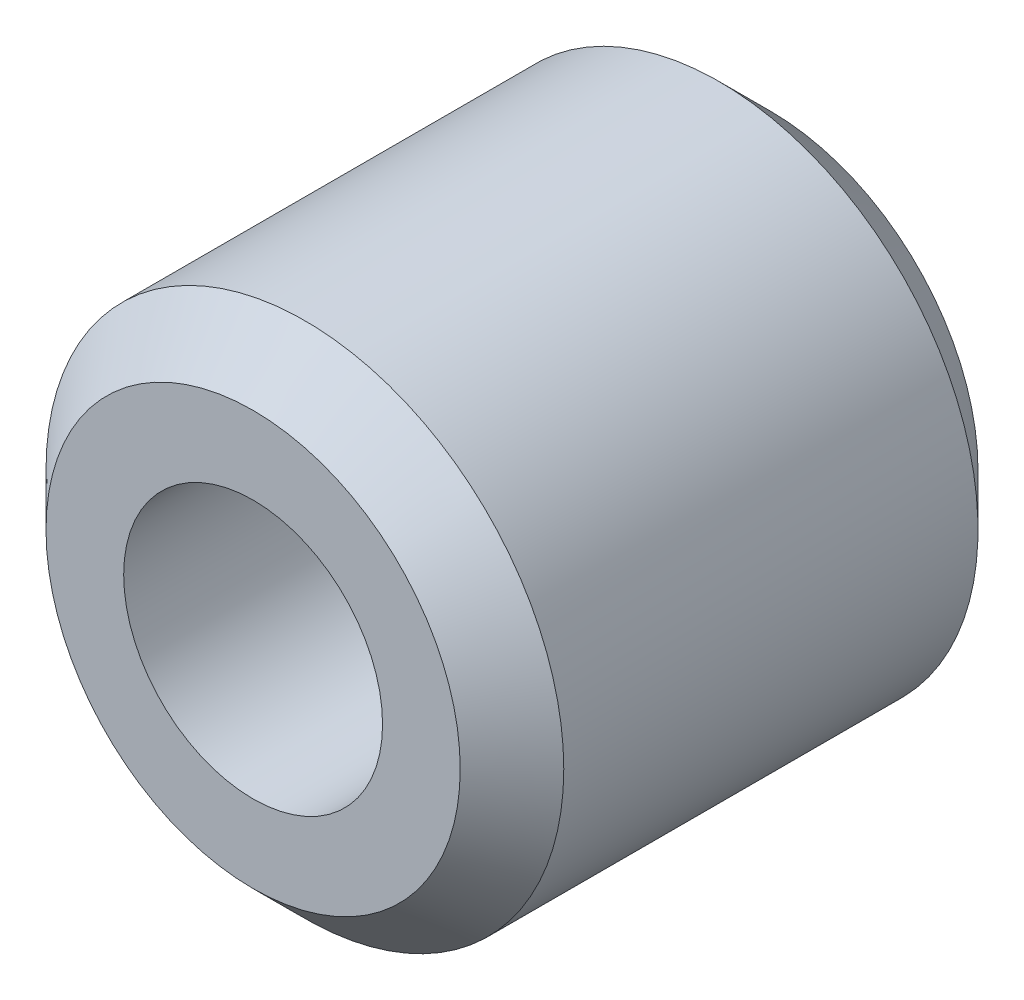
ISO-10303-21;
HEADER;
FILE_DESCRIPTION(('STEP AP214'),'2;1');
FILE_NAME('part.step','',(''),(''),'','','');
FILE_SCHEMA(('AUTOMOTIVE_DESIGN { 1 0 10303 214 1 1 1 1 }'));
ENDSEC;
DATA;
#1=APPLICATION_CONTEXT('core data for automotive mechanical design processes');
#2=APPLICATION_PROTOCOL_DEFINITION('international standard','automotive_design',2000,#1);
#3=PRODUCT_CONTEXT('',#1,'mechanical');
#4=PRODUCT('Part','Part','',(#3));
#5=PRODUCT_RELATED_PRODUCT_CATEGORY('part','',(#4));
#6=PRODUCT_DEFINITION_FORMATION('','',#4);
#7=PRODUCT_DEFINITION_CONTEXT('part definition',#1,'design');
#8=PRODUCT_DEFINITION('design','',#6,#7);
#9=PRODUCT_DEFINITION_SHAPE('','',#8);
#10=(LENGTH_UNIT() NAMED_UNIT(*) SI_UNIT(.MILLI.,.METRE.));
#11=(NAMED_UNIT(*) PLANE_ANGLE_UNIT() SI_UNIT($,.RADIAN.));
#12=(NAMED_UNIT(*) SI_UNIT($,.STERADIAN.) SOLID_ANGLE_UNIT());
#13=UNCERTAINTY_MEASURE_WITH_UNIT(LENGTH_MEASURE(1.E-05),#10,'distance_accuracy_value','');
#14=(GEOMETRIC_REPRESENTATION_CONTEXT(3) GLOBAL_UNCERTAINTY_ASSIGNED_CONTEXT((#13)) GLOBAL_UNIT_ASSIGNED_CONTEXT((#10,
#11,#12)) REPRESENTATION_CONTEXT('',''));
#15=CARTESIAN_POINT('',(0.,0.,0.));
#16=DIRECTION('',(0.,0.,1.));
#17=DIRECTION('',(1.,0.,0.));
#18=AXIS2_PLACEMENT_3D('',#15,#16,#17);
#19=CARTESIAN_POINT('',(0.,0.,0.));
#20=DIRECTION('',(0.,0.,-1.));
#21=DIRECTION('',(-1.,0.,0.));
#22=AXIS2_PLACEMENT_3D('',#19,#20,#21);
#23=CYLINDRICAL_SURFACE('',#22,2.);
#24=CARTESIAN_POINT('',(0.,0.,0.));
#25=DIRECTION('',(0.,0.,-1.));
#26=DIRECTION('',(-1.,0.,0.));
#27=AXIS2_PLACEMENT_3D('',#24,#25,#26);
#28=CIRCLE('',#27,2.);
#29=CARTESIAN_POINT('',(-2.,0.,0.));
#30=VERTEX_POINT('',#29);
#31=EDGE_CURVE('E34',#30,#30,#28,.T.);
#32=ORIENTED_EDGE('',*,*,#31,.T.);
#33=EDGE_LOOP('',(#32));
#34=FACE_BOUND('',#33,.T.);
#35=CARTESIAN_POINT('',(0.,0.,8.));
#36=DIRECTION('',(0.,0.,-1.));
#37=DIRECTION('',(-1.,0.,0.));
#38=AXIS2_PLACEMENT_3D('',#35,#36,#37);
#39=CIRCLE('',#38,2.);
#40=CARTESIAN_POINT('',(-2.,0.,8.));
#41=VERTEX_POINT('',#40);
#42=EDGE_CURVE('E31',#41,#41,#39,.T.);
#43=ORIENTED_EDGE('',*,*,#42,.F.);
#44=EDGE_LOOP('',(#43));
#45=FACE_BOUND('',#44,.T.);
#46=ADVANCED_FACE('F12',(#34,#45),#23,.F.);
#47=CARTESIAN_POINT('',(-2.,0.,8.));
#48=DIRECTION('',(0.,0.,1.));
#49=DIRECTION('',(1.,0.,0.));
#50=AXIS2_PLACEMENT_3D('',#47,#48,#49);
#51=PLANE('',#50);
#52=CARTESIAN_POINT('',(0.,0.,8.));
#53=DIRECTION('',(0.,0.,1.));
#54=DIRECTION('',(1.,0.,0.));
#55=AXIS2_PLACEMENT_3D('',#52,#53,#54);
#56=CIRCLE('',#55,3.2);
#57=CARTESIAN_POINT('',(3.2,0.,8.));
#58=VERTEX_POINT('',#57);
#59=EDGE_CURVE('E8',#58,#58,#56,.T.);
#60=ORIENTED_EDGE('',*,*,#59,.T.);
#61=EDGE_LOOP('',(#60));
#62=FACE_BOUND('',#61,.T.);
#63=ORIENTED_EDGE('',*,*,#42,.T.);
#64=EDGE_LOOP('',(#63));
#65=FACE_BOUND('',#64,.T.);
#66=ADVANCED_FACE('F55',(#62,#65),#51,.T.);
#67=CARTESIAN_POINT('',(0.,0.,0.));
#68=DIRECTION('',(0.,0.,-1.));
#69=DIRECTION('',(-1.,0.,0.));
#70=AXIS2_PLACEMENT_3D('',#67,#68,#69);
#71=CYLINDRICAL_SURFACE('',#70,4.);
#72=CARTESIAN_POINT('',(0.,0.,0.799999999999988));
#73=DIRECTION('',(0.,0.,-1.));
#74=DIRECTION('',(-1.,0.,0.));
#75=AXIS2_PLACEMENT_3D('',#72,#73,#74);
#76=CIRCLE('',#75,4.);
#77=CARTESIAN_POINT('',(-4.,0.,0.799999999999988));
#78=VERTEX_POINT('',#77);
#79=EDGE_CURVE('E18',#78,#78,#76,.F.);
#80=ORIENTED_EDGE('',*,*,#79,.T.);
#81=EDGE_LOOP('',(#80));
#82=FACE_BOUND('',#81,.T.);
#83=CARTESIAN_POINT('',(0.,0.,7.2));
#84=DIRECTION('',(0.,0.,1.));
#85=DIRECTION('',(1.,0.,0.));
#86=AXIS2_PLACEMENT_3D('',#83,#84,#85);
#87=CIRCLE('',#86,4.);
#88=CARTESIAN_POINT('',(4.,0.,7.2));
#89=VERTEX_POINT('',#88);
#90=EDGE_CURVE('E22',#89,#89,#87,.F.);
#91=ORIENTED_EDGE('',*,*,#90,.T.);
#92=EDGE_LOOP('',(#91));
#93=FACE_BOUND('',#92,.T.);
#94=ADVANCED_FACE('F43',(#82,#93),#71,.T.);
#95=CARTESIAN_POINT('',(-2.,0.,0.));
#96=DIRECTION('',(0.,0.,-1.));
#97=DIRECTION('',(-1.,0.,0.));
#98=AXIS2_PLACEMENT_3D('',#95,#96,#97);
#99=PLANE('',#98);
#100=CARTESIAN_POINT('',(0.,0.,0.));
#101=DIRECTION('',(0.,0.,-1.));
#102=DIRECTION('',(-1.,0.,0.));
#103=AXIS2_PLACEMENT_3D('',#100,#101,#102);
#104=CIRCLE('',#103,3.2);
#105=CARTESIAN_POINT('',(-3.2,0.,0.));
#106=VERTEX_POINT('',#105);
#107=EDGE_CURVE('E26',#106,#106,#104,.T.);
#108=ORIENTED_EDGE('',*,*,#107,.T.);
#109=EDGE_LOOP('',(#108));
#110=FACE_BOUND('',#109,.T.);
#111=ORIENTED_EDGE('',*,*,#31,.F.);
#112=EDGE_LOOP('',(#111));
#113=FACE_BOUND('',#112,.T.);
#114=ADVANCED_FACE('F40',(#110,#113),#99,.T.);
#115=CARTESIAN_POINT('',(0.,0.,0.));
#116=DIRECTION('',(0.,0.,1.));
#117=DIRECTION('',(1.,0.,0.));
#118=AXIS2_PLACEMENT_3D('',#115,#116,#117);
#119=CONICAL_SURFACE('',#118,3.2,0.785398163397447);
#120=ORIENTED_EDGE('',*,*,#79,.F.);
#121=EDGE_LOOP('',(#120));
#122=FACE_BOUND('',#121,.T.);
#123=ORIENTED_EDGE('',*,*,#107,.F.);
#124=EDGE_LOOP('',(#123));
#125=FACE_BOUND('',#124,.T.);
#126=ADVANCED_FACE('F42',(#122,#125),#119,.T.);
#127=CARTESIAN_POINT('',(0.,0.,7.2));
#128=DIRECTION('',(0.,0.,-1.));
#129=DIRECTION('',(-1.,0.,0.));
#130=AXIS2_PLACEMENT_3D('',#127,#128,#129);
#131=CONICAL_SURFACE('',#130,4.,0.78539816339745);
#132=ORIENTED_EDGE('',*,*,#59,.F.);
#133=EDGE_LOOP('',(#132));
#134=FACE_BOUND('',#133,.T.);
#135=ORIENTED_EDGE('',*,*,#90,.F.);
#136=EDGE_LOOP('',(#135));
#137=FACE_BOUND('',#136,.T.);
#138=ADVANCED_FACE('F52',(#134,#137),#131,.T.);
#139=CLOSED_SHELL('',(#46,#66,#94,#114,#126,#138));
#140=MANIFOLD_SOLID_BREP('B1',#139);
#141=ADVANCED_BREP_SHAPE_REPRESENTATION('',(#18,#140),#14);
#142=SHAPE_DEFINITION_REPRESENTATION(#9,#141);
ENDSEC;
END-ISO-10303-21;
